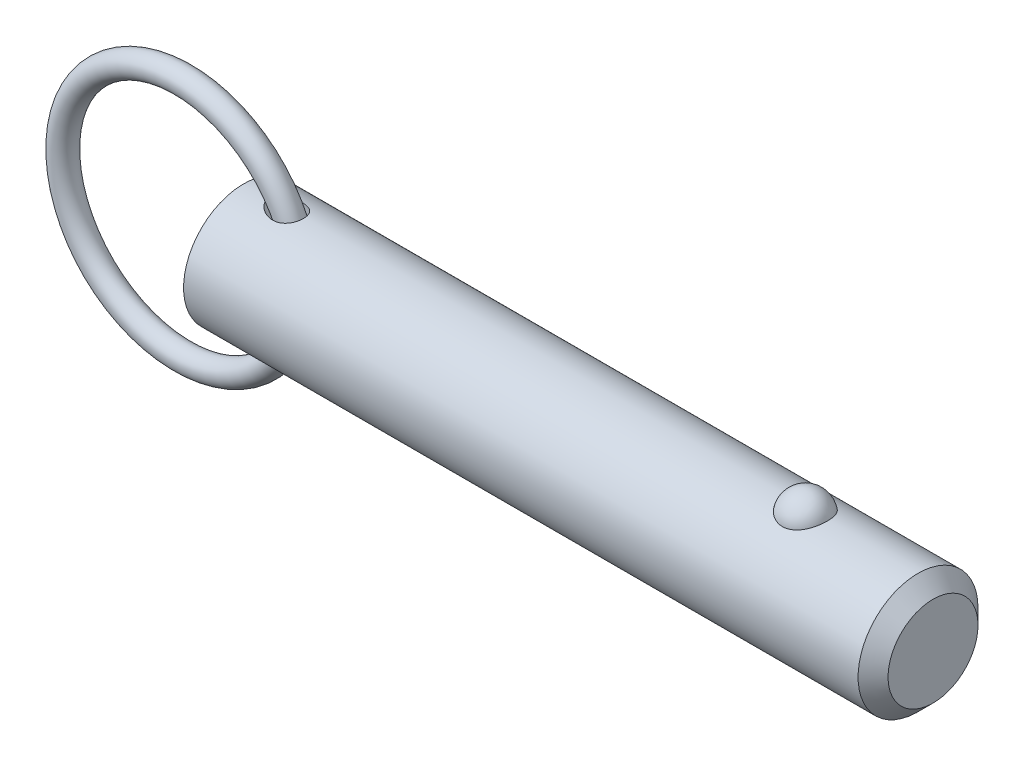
ISO-10303-21;
HEADER;
FILE_DESCRIPTION(('STEP AP214'),'2;1');
FILE_NAME('part.step','',(''),(''),'','','');
FILE_SCHEMA(('AUTOMOTIVE_DESIGN { 1 0 10303 214 1 1 1 1 }'));
ENDSEC;
DATA;
#1=APPLICATION_CONTEXT('core data for automotive mechanical design processes');
#2=APPLICATION_PROTOCOL_DEFINITION('international standard','automotive_design',2000,#1);
#3=PRODUCT_CONTEXT('',#1,'mechanical');
#4=PRODUCT('Part','Part','',(#3));
#5=PRODUCT_RELATED_PRODUCT_CATEGORY('part','',(#4));
#6=PRODUCT_DEFINITION_FORMATION('','',#4);
#7=PRODUCT_DEFINITION_CONTEXT('part definition',#1,'design');
#8=PRODUCT_DEFINITION('design','',#6,#7);
#9=PRODUCT_DEFINITION_SHAPE('','',#8);
#10=(LENGTH_UNIT() NAMED_UNIT(*) SI_UNIT(.MILLI.,.METRE.));
#11=(NAMED_UNIT(*) PLANE_ANGLE_UNIT() SI_UNIT($,.RADIAN.));
#12=(NAMED_UNIT(*) SI_UNIT($,.STERADIAN.) SOLID_ANGLE_UNIT());
#13=UNCERTAINTY_MEASURE_WITH_UNIT(LENGTH_MEASURE(1.E-05),#10,'distance_accuracy_value','');
#14=(GEOMETRIC_REPRESENTATION_CONTEXT(3) GLOBAL_UNCERTAINTY_ASSIGNED_CONTEXT((#13)) GLOBAL_UNIT_ASSIGNED_CONTEXT((#10,
#11,#12)) REPRESENTATION_CONTEXT('',''));
#15=CARTESIAN_POINT('',(0.,0.,0.));
#16=DIRECTION('',(0.,0.,1.));
#17=DIRECTION('',(1.,0.,0.));
#18=AXIS2_PLACEMENT_3D('',#15,#16,#17);
#19=CARTESIAN_POINT('',(-9.66825126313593,0.,0.));
#20=DIRECTION('',(0.,0.,1.));
#21=DIRECTION('',(1.,0.,0.));
#22=AXIS2_PLACEMENT_3D('',#19,#20,#21);
#23=TOROIDAL_SURFACE('',#22,19.05,1.905);
#24=CARTESIAN_POINT('',(11.2867487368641,0.,0.));
#25=VERTEX_POINT('',#24);
#26=VERTEX_LOOP('',#25);
#27=FACE_BOUND('',#26,.T.);
#28=ADVANCED_FACE('P0_F12',(#27),#23,.T.);
#29=CLOSED_SHELL('',(#28));
#30=MANIFOLD_SOLID_BREP('P0_B1',#29);
#31=CARTESIAN_POINT('',(0.,0.,0.));
#32=DIRECTION('',(1.,0.,0.));
#33=DIRECTION('',(0.,0.,-1.));
#34=AXIS2_PLACEMENT_3D('',#31,#32,#33);
#35=CYLINDRICAL_SURFACE('',#34,9.525);
#36=CARTESIAN_POINT('',(4.56693409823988,9.43141941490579,-1.33189820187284));
#37=CARTESIAN_POINT('',(4.70260475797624,9.41020313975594,-1.48215931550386));
#38=CARTESIAN_POINT('',(4.85555680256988,9.38755003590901,-1.61683982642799));
#39=CARTESIAN_POINT('',(5.10171959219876,9.35450554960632,-1.79512943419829));
#40=CARTESIAN_POINT('',(5.18674514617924,9.34362629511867,-1.85068909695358));
#41=CARTESIAN_POINT('',(5.36154389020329,9.32258514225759,-1.95392002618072));
#42=CARTESIAN_POINT('',(5.45131542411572,9.31242299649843,-2.00159402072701));
#43=CARTESIAN_POINT('',(5.70070211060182,9.28632120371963,-2.12033289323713));
#44=CARTESIAN_POINT('',(5.86420408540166,9.27146938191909,-2.18362944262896));
#45=CARTESIAN_POINT('',(6.19893345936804,9.24694163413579,-2.28525783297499));
#46=CARTESIAN_POINT('',(6.37015384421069,9.23726110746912,-2.32361187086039));
#47=CARTESIAN_POINT('',(6.73531776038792,9.22400982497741,-2.37575048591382));
#48=CARTESIAN_POINT('',(6.92975826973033,9.22118808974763,-2.38652934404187));
#49=CARTESIAN_POINT('',(7.21995443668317,9.22416297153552,-2.37494980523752));
#50=CARTESIAN_POINT('',(7.31643847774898,9.22635560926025,-2.366466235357));
#51=CARTESIAN_POINT('',(7.50796421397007,9.2331428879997,-2.33985028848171));
#52=CARTESIAN_POINT('',(7.60300650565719,9.23773650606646,-2.32172202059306));
#53=CARTESIAN_POINT('',(7.83273114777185,9.25183311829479,-2.26504721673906));
#54=CARTESIAN_POINT('',(7.96603028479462,9.26261470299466,-2.2209856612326));
#55=CARTESIAN_POINT('',(8.22310899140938,9.28816519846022,-2.11157306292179));
#56=CARTESIAN_POINT('',(8.34689477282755,9.30293147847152,-2.04623606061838));
#57=CARTESIAN_POINT('',(8.58136049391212,9.3349416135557,-1.89485344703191));
#58=CARTESIAN_POINT('',(8.69199721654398,9.35219324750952,-1.80874222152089));
#59=CARTESIAN_POINT('',(8.89592093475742,9.38707016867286,-1.61799188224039));
#60=CARTESIAN_POINT('',(8.98920771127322,9.40469546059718,-1.51335253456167));
#61=CARTESIAN_POINT('',(9.15057731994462,9.43713590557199,-1.29519427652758));
#62=CARTESIAN_POINT('',(9.21980158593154,9.45205440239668,-1.18253282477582));
#63=CARTESIAN_POINT('',(9.33826736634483,9.47856708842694,-0.946802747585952));
#64=CARTESIAN_POINT('',(9.38751161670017,9.49016173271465,-0.823735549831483));
#65=CARTESIAN_POINT('',(9.46423850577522,9.50859378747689,-0.572614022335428));
#66=CARTESIAN_POINT('',(9.4920239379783,9.5154972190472,-0.444656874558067));
#67=CARTESIAN_POINT('',(9.52636926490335,9.52406905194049,-0.185752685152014));
#68=CARTESIAN_POINT('',(9.5329292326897,9.52573747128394,-0.0548056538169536));
#69=CARTESIAN_POINT('',(9.52467276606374,9.52365852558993,0.206503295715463));
#70=CARTESIAN_POINT('',(9.50983454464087,9.51990564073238,0.336864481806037));
#71=CARTESIAN_POINT('',(9.45907362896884,9.50737852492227,0.59316631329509));
#72=CARTESIAN_POINT('',(9.42315106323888,9.49860432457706,0.71910698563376));
#73=CARTESIAN_POINT('',(9.33106648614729,9.47698928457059,0.96295935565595));
#74=CARTESIAN_POINT('',(9.27490839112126,9.46414923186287,1.08087260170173));
#75=CARTESIAN_POINT('',(9.1437580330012,9.43581000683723,1.30534632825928));
#76=CARTESIAN_POINT('',(9.06876720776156,9.42031103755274,1.41190767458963));
#77=CARTESIAN_POINT('',(8.90203187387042,9.38836719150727,1.61069439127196));
#78=CARTESIAN_POINT('',(8.81029913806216,9.37192298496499,1.70292975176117));
#79=CARTESIAN_POINT('',(8.61268775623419,9.33985045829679,1.87086859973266));
#80=CARTESIAN_POINT('',(8.50680947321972,9.3242221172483,1.94657251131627));
#81=CARTESIAN_POINT('',(8.28220546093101,9.29513431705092,2.08109032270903));
#82=CARTESIAN_POINT('',(8.16329919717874,9.28171415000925,2.1396103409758));
#83=CARTESIAN_POINT('',(7.91756052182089,9.25859072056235,2.23755716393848));
#84=CARTESIAN_POINT('',(7.79072606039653,9.24888842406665,2.27697900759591));
#85=CARTESIAN_POINT('',(7.52377913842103,9.23338749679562,2.33907806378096));
#86=CARTESIAN_POINT('',(7.38334767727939,9.22789571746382,2.36044900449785));
#87=CARTESIAN_POINT('',(7.10081394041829,9.22210229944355,2.3829751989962));
#88=CARTESIAN_POINT('',(6.95871103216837,9.22180269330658,2.38412253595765));
#89=CARTESIAN_POINT('',(6.65642691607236,9.22632724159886,2.36656230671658));
#90=CARTESIAN_POINT('',(6.49641694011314,9.23185415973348,2.3451317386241));
#91=CARTESIAN_POINT('',(6.18115433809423,9.24811737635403,2.28014143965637));
#92=CARTESIAN_POINT('',(6.02590710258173,9.25885936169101,2.23655754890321));
#93=CARTESIAN_POINT('',(5.6990472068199,9.28624254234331,2.12025087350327));
#94=CARTESIAN_POINT('',(5.52873601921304,9.30354853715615,2.04400672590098));
#95=CARTESIAN_POINT('',(5.20289495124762,9.34106989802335,1.86504730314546));
#96=CARTESIAN_POINT('',(5.04735968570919,9.36128419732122,1.76234172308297));
#97=CARTESIAN_POINT('',(4.79287124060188,9.39697639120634,1.55895334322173));
#98=CARTESIAN_POINT('',(4.68938704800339,9.41240250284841,1.46392900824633));
#99=CARTESIAN_POINT('',(4.49847141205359,9.44202586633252,1.25875918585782));
#100=CARTESIAN_POINT('',(4.41101129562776,9.45622528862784,1.1486413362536));
#101=CARTESIAN_POINT('',(4.27502257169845,9.47888210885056,0.940600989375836));
#102=CARTESIAN_POINT('',(4.22216329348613,9.48791121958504,0.845586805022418));
#103=CARTESIAN_POINT('',(4.13241478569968,9.50344321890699,0.648051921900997));
#104=CARTESIAN_POINT('',(4.09551182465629,9.50994827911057,0.545537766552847));
#105=CARTESIAN_POINT('',(4.04043124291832,9.51971586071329,0.334452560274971));
#106=CARTESIAN_POINT('',(4.02240728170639,9.52295176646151,0.225839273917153));
#107=CARTESIAN_POINT('',(4.00750873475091,9.52562364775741,0.00713006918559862));
#108=CARTESIAN_POINT('',(4.01062334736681,9.52506156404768,-0.10296506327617));
#109=CARTESIAN_POINT('',(4.03592967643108,9.52053221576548,-0.306944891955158));
#110=CARTESIAN_POINT('',(4.05571676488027,9.51699426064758,-0.401151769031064));
#111=CARTESIAN_POINT('',(4.10967975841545,9.5074546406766,-0.585176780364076));
#112=CARTESIAN_POINT('',(4.14385995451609,9.50145224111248,-0.674993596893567));
#113=CARTESIAN_POINT('',(4.23261356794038,9.48611703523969,-0.866116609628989));
#114=CARTESIAN_POINT('',(4.28990016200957,9.47635800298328,-0.96612166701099));
#115=CARTESIAN_POINT('',(4.41856577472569,9.45502867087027,-1.15640011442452));
#116=CARTESIAN_POINT('',(4.48996918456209,9.44345524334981,-1.24665623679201));
#117=CARTESIAN_POINT('',(4.56693409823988,9.43141941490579,-1.33189820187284));
#118=B_SPLINE_CURVE_WITH_KNOTS('',3,(#36,#37,#38,#39,#40,#41,#42,#43,#44,#45,#46,#47,#48,#49,
#50,#51,#52,#53,#54,#55,#56,#57,#58,#59,#60,#61,#62,#63,#64,#65,#66,#67,#68,#69,#70,#71,#72,#73,
#74,#75,#76,#77,#78,#79,#80,#81,#82,#83,#84,#85,#86,#87,#88,#89,#90,#91,#92,#93,#94,#95,#96,#97,
#98,#99,#100,#101,#102,#103,#104,#105,#106,#107,#108,#109,#110,#111,#112,#113,#114,#115,#116,
#117),.UNSPECIFIED.,.T.,.F.,(4,2,2,2,2,2,2,2,2,2,2,2,2,2,2,2,2,2,2,2,2,2,2,2,2,2,2,2,2,2,2,2,2,
2,2,2,2,2,2,2,4),(0.,0.609951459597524,0.916123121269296,1.22218863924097,1.74791337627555,
2.27316961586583,2.85362722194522,3.14383229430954,3.43391382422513,3.85437497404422,
4.27455920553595,4.69608835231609,5.11762282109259,5.5149005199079,5.91212379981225,
6.30363414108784,6.69514313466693,7.08705103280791,7.47895654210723,7.87078624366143,
8.26258603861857,8.65411137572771,9.04562666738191,9.44349251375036,9.84146165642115,
10.2662286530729,10.6911619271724,11.1739180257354,11.6572017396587,12.2170157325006,
12.7766249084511,13.1992556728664,13.6211226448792,13.9471990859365,14.2729943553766,
14.6014211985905,14.9296802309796,15.2173810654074,15.505167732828,15.8505863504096,
16.1966070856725),.UNSPECIFIED.);
#119=CARTESIAN_POINT('',(4.56693409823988,9.43141941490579,-1.33189820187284));
#120=VERTEX_POINT('',#119);
#121=EDGE_CURVE('P1_E40',#120,#120,#118,.T.);
#122=ORIENTED_EDGE('',*,*,#121,.T.);
#123=EDGE_LOOP('',(#122));
#124=FACE_BOUND('',#123,.T.);
#125=CARTESIAN_POINT('',(107.14875,0.,0.));
#126=DIRECTION('',(1.,0.,0.));
#127=DIRECTION('',(0.,0.,-1.));
#128=AXIS2_PLACEMENT_3D('',#125,#126,#127);
#129=CIRCLE('',#128,9.525);
#130=CARTESIAN_POINT('',(107.14875,0.,-9.525));
#131=VERTEX_POINT('',#130);
#132=EDGE_CURVE('P1_E25',#131,#131,#129,.T.);
#133=ORIENTED_EDGE('',*,*,#132,.F.);
#134=EDGE_LOOP('',(#133));
#135=FACE_BOUND('',#134,.T.);
#136=CARTESIAN_POINT('',(0.,0.,0.));
#137=DIRECTION('',(1.,0.,0.));
#138=DIRECTION('',(0.,0.,-1.));
#139=AXIS2_PLACEMENT_3D('',#136,#137,#138);
#140=CIRCLE('',#139,9.525);
#141=CARTESIAN_POINT('',(0.,0.,-9.525));
#142=VERTEX_POINT('',#141);
#143=EDGE_CURVE('P1_E9',#142,#142,#140,.T.);
#144=ORIENTED_EDGE('',*,*,#143,.T.);
#145=EDGE_LOOP('',(#144));
#146=FACE_BOUND('',#145,.T.);
#147=CARTESIAN_POINT('',(89.2457573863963,8.80405803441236,3.63513233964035));
#148=CARTESIAN_POINT('',(89.1516766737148,8.80405953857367,3.63513053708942));
#149=CARTESIAN_POINT('',(89.0575618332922,8.80561325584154,3.6313746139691));
#150=CARTESIAN_POINT('',(88.8700126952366,8.81177748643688,3.61638665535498));
#151=CARTESIAN_POINT('',(88.7765788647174,8.81638992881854,3.60514990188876));
#152=CARTESIAN_POINT('',(88.4979452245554,8.8346711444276,3.56024627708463));
#153=CARTESIAN_POINT('',(88.3146916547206,8.85278327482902,3.51538626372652));
#154=CARTESIAN_POINT('',(87.959509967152,8.89871214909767,3.39742145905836));
#155=CARTESIAN_POINT('',(87.7875533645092,8.92650327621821,3.32439116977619));
#156=CARTESIAN_POINT('',(87.458707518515,8.98874819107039,3.15220244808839));
#157=CARTESIAN_POINT('',(87.3018114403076,9.02319893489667,3.05305594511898));
#158=CARTESIAN_POINT('',(87.0022147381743,9.09629186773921,2.82797815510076));
#159=CARTESIAN_POINT('',(86.8600600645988,9.13502685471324,2.7013513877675));
#160=CARTESIAN_POINT('',(86.5982999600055,9.21186572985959,2.4264193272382));
#161=CARTESIAN_POINT('',(86.4787015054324,9.2499694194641,2.27810735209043));
#162=CARTESIAN_POINT('',(86.259645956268,9.32341082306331,1.95652290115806));
#163=CARTESIAN_POINT('',(86.1613174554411,9.35855090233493,1.78243511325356));
#164=CARTESIAN_POINT('',(85.9938190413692,9.42045142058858,1.41937246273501));
#165=CARTESIAN_POINT('',(85.9246511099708,9.44721128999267,1.23039658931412));
#166=CARTESIAN_POINT('',(85.8161994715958,9.48990641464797,0.840370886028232));
#167=CARTESIAN_POINT('',(85.7772880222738,9.50570658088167,0.639202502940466));
#168=CARTESIAN_POINT('',(85.7315550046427,9.52433146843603,0.232664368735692));
#169=CARTESIAN_POINT('',(85.7247324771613,9.52715657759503,0.0272947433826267));
#170=CARTESIAN_POINT('',(85.743255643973,9.51956918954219,-0.380478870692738));
#171=CARTESIAN_POINT('',(85.7684052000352,9.50923740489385,-0.582893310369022));
#172=CARTESIAN_POINT('',(85.8500253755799,9.47651897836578,-0.98029399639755));
#173=CARTESIAN_POINT('',(85.9064966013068,9.45413210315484,-1.17528009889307));
#174=CARTESIAN_POINT('',(86.0497192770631,9.39954044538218,-1.55263697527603));
#175=CARTESIAN_POINT('',(86.1365124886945,9.36732213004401,-1.73498993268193));
#176=CARTESIAN_POINT('',(86.3386103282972,9.29640700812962,-2.08177763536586));
#177=CARTESIAN_POINT('',(86.4539172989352,9.25770966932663,-2.24621090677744));
#178=CARTESIAN_POINT('',(86.711264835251,9.17775604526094,-2.55338333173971));
#179=CARTESIAN_POINT('',(86.8534344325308,9.136488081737,-2.69601150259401));
#180=CARTESIAN_POINT('',(87.16089985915,9.05620497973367,-2.95451229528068));
#181=CARTESIAN_POINT('',(87.326193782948,9.01718965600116,-3.07038711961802));
#182=CARTESIAN_POINT('',(87.672052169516,8.9468001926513,-3.26976836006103));
#183=CARTESIAN_POINT('',(87.8522278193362,8.91528408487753,-3.35389750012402));
#184=CARTESIAN_POINT('',(88.2256514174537,8.86272514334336,-3.49043503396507));
#185=CARTESIAN_POINT('',(88.418894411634,8.8416783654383,-3.54285537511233));
#186=CARTESIAN_POINT('',(88.8025036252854,8.81348056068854,-3.61241306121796));
#187=CARTESIAN_POINT('',(88.9925251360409,8.80568348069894,-3.63119339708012));
#188=CARTESIAN_POINT('',(89.3731906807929,8.80289410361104,-3.63795342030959));
#189=CARTESIAN_POINT('',(89.5638345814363,8.80789922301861,-3.62593932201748));
#190=CARTESIAN_POINT('',(89.934007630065,8.8297491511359,-3.57238430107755));
#191=CARTESIAN_POINT('',(90.1136976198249,8.84621463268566,-3.53178890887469));
#192=CARTESIAN_POINT('',(90.4634226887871,8.88875330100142,-3.42331083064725));
#193=CARTESIAN_POINT('',(90.6334569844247,8.91482726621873,-3.35542593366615));
#194=CARTESIAN_POINT('',(90.9632377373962,8.97448239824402,-3.19248225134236));
#195=CARTESIAN_POINT('',(91.1226801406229,9.00821446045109,-3.09686474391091));
#196=CARTESIAN_POINT('',(91.4235136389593,9.07935398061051,-2.88162736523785));
#197=CARTESIAN_POINT('',(91.5649005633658,9.11676228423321,-2.76200196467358));
#198=CARTESIAN_POINT('',(91.8333193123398,9.19347419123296,-2.49516285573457));
#199=CARTESIAN_POINT('',(91.9592750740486,9.23277872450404,-2.34686614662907));
#200=CARTESIAN_POINT('',(92.1855227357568,9.30737610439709,-2.03093683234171));
#201=CARTESIAN_POINT('',(92.2858100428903,9.34266823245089,-1.86330077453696));
#202=CARTESIAN_POINT('',(92.4615149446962,9.40674710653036,-1.50744893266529));
#203=CARTESIAN_POINT('',(92.536041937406,9.43529176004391,-1.31874876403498));
#204=CARTESIAN_POINT('',(92.6541650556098,9.48144132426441,-0.930631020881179));
#205=CARTESIAN_POINT('',(92.6977608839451,9.49904612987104,-0.731213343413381));
#206=CARTESIAN_POINT('',(92.7531580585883,9.5215314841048,-0.32714729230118));
#207=CARTESIAN_POINT('',(92.7649354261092,9.52640243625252,-0.122495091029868));
#208=CARTESIAN_POINT('',(92.7563825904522,9.52289571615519,0.286018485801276));
#209=CARTESIAN_POINT('',(92.7360530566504,9.51451832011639,0.489879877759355));
#210=CARTESIAN_POINT('',(92.6638840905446,9.48544083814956,0.889994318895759));
#211=CARTESIAN_POINT('',(92.6121993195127,9.46480124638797,1.08627971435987));
#212=CARTESIAN_POINT('',(92.4784917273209,9.41333895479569,1.46682086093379));
#213=CARTESIAN_POINT('',(92.3964668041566,9.38251554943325,1.65107577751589));
#214=CARTESIAN_POINT('',(92.2031929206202,9.31365636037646,2.00346348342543));
#215=CARTESIAN_POINT('',(92.0917838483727,9.27558138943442,2.17150083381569));
#216=CARTESIAN_POINT('',(91.8422947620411,9.19638714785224,2.4856311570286));
#217=CARTESIAN_POINT('',(91.7042163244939,9.15526805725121,2.63172542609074));
#218=CARTESIAN_POINT('',(91.4048438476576,9.07465393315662,2.89750997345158));
#219=CARTESIAN_POINT('',(91.2436109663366,9.03515496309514,3.01726776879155));
#220=CARTESIAN_POINT('',(90.9016136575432,8.96227564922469,3.22732920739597));
#221=CARTESIAN_POINT('',(90.720841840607,8.92889763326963,3.31762165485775));
#222=CARTESIAN_POINT('',(90.3514451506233,8.8734538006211,3.46314419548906));
#223=CARTESIAN_POINT('',(90.1633237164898,8.85102983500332,3.51950082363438));
#224=CARTESIAN_POINT('',(89.8757869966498,8.82666967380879,3.57993683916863));
#225=CARTESIAN_POINT('',(89.7791339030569,8.82009725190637,3.59606217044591));
#226=CARTESIAN_POINT('',(89.5846770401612,8.81020897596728,3.62022512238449));
#227=CARTESIAN_POINT('',(89.4868741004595,8.80689090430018,3.62826825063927));
#228=CARTESIAN_POINT('',(89.3412243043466,8.80445615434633,3.63416760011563));
#229=CARTESIAN_POINT('',(89.2934952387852,8.80405727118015,3.63513325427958));
#230=CARTESIAN_POINT('',(89.2457573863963,8.80405803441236,3.63513233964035));
#231=B_SPLINE_CURVE_WITH_KNOTS('',3,(#147,#148,#149,#150,#151,#152,#153,#154,#155,#156,#157,
#158,#159,#160,#161,#162,#163,#164,#165,#166,#167,#168,#169,#170,#171,#172,#173,#174,#175,#176,
#177,#178,#179,#180,#181,#182,#183,#184,#185,#186,#187,#188,#189,#190,#191,#192,#193,#194,#195,
#196,#197,#198,#199,#200,#201,#202,#203,#204,#205,#206,#207,#208,#209,#210,#211,#212,#213,#214,
#215,#216,#217,#218,#219,#220,#221,#222,#223,#224,#225,#226,#227,#228,#229,#230),.UNSPECIFIED.,
.T.,.F.,(4,2,2,2,2,2,2,2,2,2,2,2,2,2,2,2,2,2,2,2,2,2,2,2,2,2,2,2,2,2,2,2,2,2,2,2,2,2,2,2,2,4),
(0.,0.282202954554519,0.564584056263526,1.13017050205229,1.69427128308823,2.258114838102,
2.83836627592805,3.41879688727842,4.02497117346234,4.63118665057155,5.24474754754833,
5.85829010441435,6.46808687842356,7.0778954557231,7.68854723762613,8.29924920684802,
8.91296283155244,9.52662591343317,10.1275338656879,10.7282152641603,11.2986646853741,
11.868998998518,12.4213015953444,12.973648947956,13.5380053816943,14.1024919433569,
14.695298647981,15.2882113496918,15.8999469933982,16.5116885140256,17.1238909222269,
17.7360805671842,18.3452748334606,18.9545113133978,19.567138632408,20.1797297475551,
20.7907316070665,21.4019653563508,21.9915938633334,22.2859053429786,22.580016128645,
22.723209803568),.UNSPECIFIED.);
#232=CARTESIAN_POINT('',(89.2457573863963,8.80405803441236,3.63513233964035));
#233=VERTEX_POINT('',#232);
#234=EDGE_CURVE('P1_E34',#233,#233,#231,.T.);
#235=ORIENTED_EDGE('',*,*,#234,.T.);
#236=EDGE_LOOP('',(#235));
#237=FACE_BOUND('',#236,.T.);
#238=CARTESIAN_POINT('',(4.56693409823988,-9.43141941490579,-1.33189820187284));
#239=CARTESIAN_POINT('',(4.48932984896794,-9.4435553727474,-1.24594548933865));
#240=CARTESIAN_POINT('',(4.41737309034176,-9.45522193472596,-1.1548795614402));
#241=CARTESIAN_POINT('',(4.2878104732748,-9.47670896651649,-0.962782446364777));
#242=CARTESIAN_POINT('',(4.23019403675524,-9.48653079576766,-0.861758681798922));
#243=CARTESIAN_POINT('',(4.13254559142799,-9.5034118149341,-0.649723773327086));
#244=CARTESIAN_POINT('',(4.09271158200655,-9.51043980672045,-0.538615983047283));
#245=CARTESIAN_POINT('',(4.04973167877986,-9.51806966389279,-0.367764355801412));
#246=CARTESIAN_POINT('',(4.03820037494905,-9.52012756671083,-0.310118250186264));
#247=CARTESIAN_POINT('',(4.02100287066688,-9.52320274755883,-0.193935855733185));
#248=CARTESIAN_POINT('',(4.01533565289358,-9.52422020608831,-0.13539972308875));
#249=CARTESIAN_POINT('',(4.00817074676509,-9.52550497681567,0.0247266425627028));
#250=CARTESIAN_POINT('',(4.01270492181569,-9.52468821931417,0.126661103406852));
#251=CARTESIAN_POINT('',(4.03954973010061,-9.51988506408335,0.328012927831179));
#252=CARTESIAN_POINT('',(4.06186450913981,-9.51589792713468,0.427429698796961));
#253=CARTESIAN_POINT('',(4.12088980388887,-9.5054852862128,0.61636200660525));
#254=CARTESIAN_POINT('',(4.15684838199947,-9.49918763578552,0.706123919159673));
#255=CARTESIAN_POINT('',(4.24094647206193,-9.48470618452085,0.879522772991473));
#256=CARTESIAN_POINT('',(4.28909090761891,-9.47652162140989,0.96315722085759));
#257=CARTESIAN_POINT('',(4.42295891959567,-9.45426317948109,1.16513741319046));
#258=CARTESIAN_POINT('',(4.5152375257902,-9.43933320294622,1.27905352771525));
#259=CARTESIAN_POINT('',(4.71682295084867,-9.40825940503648,1.49055892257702));
#260=CARTESIAN_POINT('',(4.8261728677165,-9.39211256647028,1.58810554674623));
#261=CARTESIAN_POINT('',(5.09064226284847,-9.35555264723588,1.79246125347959));
#262=CARTESIAN_POINT('',(5.24990411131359,-9.33524115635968,1.89393122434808));
#263=CARTESIAN_POINT('',(5.58309255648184,-9.29785396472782,2.06968659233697));
#264=CARTESIAN_POINT('',(5.7570289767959,-9.28078045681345,2.14395359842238));
#265=CARTESIAN_POINT('',(6.11646882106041,-9.25213303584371,2.26440412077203));
#266=CARTESIAN_POINT('',(6.30205582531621,-9.2406056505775,2.31035092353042));
#267=CARTESIAN_POINT('',(6.67856093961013,-9.22541807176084,2.37029728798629));
#268=CARTESIAN_POINT('',(6.8694704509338,-9.2217458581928,2.3843456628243));
#269=CARTESIAN_POINT('',(7.21217144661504,-9.22344239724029,2.37775005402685));
#270=CARTESIAN_POINT('',(7.36409439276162,-9.22713860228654,2.36352577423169));
#271=CARTESIAN_POINT('',(7.66346227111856,-9.24048072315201,2.31082299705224));
#272=CARTESIAN_POINT('',(7.81090958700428,-9.25012341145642,2.27235765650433));
#273=CARTESIAN_POINT('',(8.09730316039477,-9.2746609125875,2.17003648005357));
#274=CARTESIAN_POINT('',(8.23619652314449,-9.28958517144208,2.10603803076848));
#275=CARTESIAN_POINT('',(8.49918675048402,-9.32290326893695,1.9532444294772));
#276=CARTESIAN_POINT('',(8.62328895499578,-9.34129584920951,1.86445826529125));
#277=CARTESIAN_POINT('',(8.84006515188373,-9.37706953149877,1.67466761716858));
#278=CARTESIAN_POINT('',(8.93465172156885,-9.39436331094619,1.57582357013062));
#279=CARTESIAN_POINT('',(9.1049023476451,-9.42761680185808,1.362809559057));
#280=CARTESIAN_POINT('',(9.18057146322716,-9.44357686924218,1.24864370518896));
#281=CARTESIAN_POINT('',(9.30789178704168,-9.47159985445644,1.01379272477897));
#282=CARTESIAN_POINT('',(9.36045544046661,-9.48380365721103,0.893617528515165));
#283=CARTESIAN_POINT('',(9.44498362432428,-9.50388751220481,0.645890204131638));
#284=CARTESIAN_POINT('',(9.47694947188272,-9.51176784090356,0.518338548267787));
#285=CARTESIAN_POINT('',(9.51944262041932,-9.52232073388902,0.260103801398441));
#286=CARTESIAN_POINT('',(9.53006646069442,-9.52501674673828,0.129437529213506));
#287=CARTESIAN_POINT('',(9.52993291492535,-9.52498309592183,-0.131885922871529));
#288=CARTESIAN_POINT('',(9.51917525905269,-9.52225336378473,-0.262543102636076));
#289=CARTESIAN_POINT('',(9.47648788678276,-9.51165418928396,-0.520312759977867));
#290=CARTESIAN_POINT('',(9.44453086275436,-9.50377811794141,-0.647420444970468));
#291=CARTESIAN_POINT('',(9.36015568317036,-9.48373425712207,-0.894290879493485));
#292=CARTESIAN_POINT('',(9.30773827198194,-9.47156662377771,-1.01405389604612));
#293=CARTESIAN_POINT('',(9.18380895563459,-9.44428888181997,-1.24269386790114));
#294=CARTESIAN_POINT('',(9.11232064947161,-9.42918241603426,-1.3515840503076));
#295=CARTESIAN_POINT('',(8.95212687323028,-9.39767706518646,-1.55562459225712));
#296=CARTESIAN_POINT('',(8.86342281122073,-9.3812782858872,-1.65077607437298));
#297=CARTESIAN_POINT('',(8.6710444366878,-9.34891827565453,-1.82517515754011));
#298=CARTESIAN_POINT('',(8.56732858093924,-9.33295841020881,-1.90437711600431));
#299=CARTESIAN_POINT('',(8.34818438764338,-9.30317889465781,-2.0449122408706));
#300=CARTESIAN_POINT('',(8.23275529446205,-9.2893593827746,-2.10624425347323));
#301=CARTESIAN_POINT('',(7.98961240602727,-9.26475003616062,-2.2120340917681));
#302=CARTESIAN_POINT('',(7.86162088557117,-9.25407358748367,-2.25587700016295));
#303=CARTESIAN_POINT('',(7.60027499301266,-9.23720810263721,-2.32397032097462));
#304=CARTESIAN_POINT('',(7.46691858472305,-9.23102078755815,-2.34821321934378));
#305=CARTESIAN_POINT('',(7.18516230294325,-9.22302718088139,-2.37943079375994));
#306=CARTESIAN_POINT('',(7.0365445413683,-9.22169704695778,-2.38452997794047));
#307=CARTESIAN_POINT('',(6.74015049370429,-9.22442327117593,-2.37395141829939));
#308=CARTESIAN_POINT('',(6.59237455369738,-9.22848170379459,-2.35826567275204));
#309=CARTESIAN_POINT('',(6.27762777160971,-9.2422287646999,-2.30385559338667));
#310=CARTESIAN_POINT('',(6.11124715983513,-9.25269504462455,-2.26192683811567));
#311=CARTESIAN_POINT('',(5.78635920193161,-9.27830776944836,-2.15445569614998));
#312=CARTESIAN_POINT('',(5.62786567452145,-9.29346211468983,-2.08887341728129));
#313=CARTESIAN_POINT('',(5.3901306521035,-9.31931237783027,-1.96924953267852));
#314=CARTESIAN_POINT('',(5.30683088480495,-9.32901725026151,-1.92292485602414));
#315=CARTESIAN_POINT('',(5.14455801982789,-9.34899035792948,-1.82334419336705));
#316=CARTESIAN_POINT('',(5.06558607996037,-9.35925874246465,-1.77008636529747));
#317=CARTESIAN_POINT('',(4.83670950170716,-9.39034445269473,-1.60010986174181));
#318=CARTESIAN_POINT('',(4.69422471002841,-9.41151337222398,-1.47288240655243));
#319=CARTESIAN_POINT('',(4.56693409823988,-9.43141941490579,-1.33189820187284));
#320=B_SPLINE_CURVE_WITH_KNOTS('',3,(#238,#239,#240,#241,#242,#243,#244,#245,#246,#247,#248,
#249,#250,#251,#252,#253,#254,#255,#256,#257,#258,#259,#260,#261,#262,#263,#264,#265,#266,#267,
#268,#269,#270,#271,#272,#273,#274,#275,#276,#277,#278,#279,#280,#281,#282,#283,#284,#285,#286,
#287,#288,#289,#290,#291,#292,#293,#294,#295,#296,#297,#298,#299,#300,#301,#302,#303,#304,#305,
#306,#307,#308,#309,#310,#311,#312,#313,#314,#315,#316,#317,#318,#319),.UNSPECIFIED.,.T.,.F.,(4,
2,2,2,2,2,2,2,2,2,2,2,2,2,2,2,2,2,2,2,2,2,2,2,2,2,2,2,2,2,2,2,2,2,2,2,2,2,2,2,4),(0.,
0.348900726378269,0.697543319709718,1.0499765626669,1.22617690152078,1.40234666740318,
1.70666745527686,2.01105922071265,2.30066493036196,2.59038784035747,3.03001384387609,
3.4707682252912,4.03766594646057,4.60494622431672,5.17690598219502,5.74798989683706,
6.2040084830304,6.65977977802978,7.11813321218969,7.57632066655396,7.98791759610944,
8.39940433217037,8.79273459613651,9.18603970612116,9.577561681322,9.96908859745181,
10.3611208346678,10.7531388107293,11.1446739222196,11.536177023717,11.9287850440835,
12.3214184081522,12.7268448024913,13.1324265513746,13.5768390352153,14.0214226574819,
14.5351685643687,15.0497849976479,15.3368801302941,15.6240516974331,16.1963372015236),.UNSPECIFIED.);
#321=CARTESIAN_POINT('',(4.56693409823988,-9.43141941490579,-1.33189820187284));
#322=VERTEX_POINT('',#321);
#323=EDGE_CURVE('P1_E17',#322,#322,#320,.T.);
#324=ORIENTED_EDGE('',*,*,#323,.T.);
#325=EDGE_LOOP('',(#324));
#326=FACE_BOUND('',#325,.T.);
#327=ADVANCED_FACE('P1_F13',(#124,#135,#146,#237,#326),#35,.T.);
#328=CARTESIAN_POINT('',(0.,0.,0.));
#329=DIRECTION('',(-1.,0.,0.));
#330=DIRECTION('',(0.,0.,1.));
#331=AXIS2_PLACEMENT_3D('',#328,#329,#330);
#332=PLANE('',#331);
#333=ORIENTED_EDGE('',*,*,#143,.F.);
#334=EDGE_LOOP('',(#333));
#335=FACE_BOUND('',#334,.T.);
#336=ADVANCED_FACE('P1_F15',(#335),#332,.T.);
#337=CARTESIAN_POINT('',(109.53,0.,0.));
#338=DIRECTION('',(-1.,0.,0.));
#339=DIRECTION('',(0.,0.,1.));
#340=AXIS2_PLACEMENT_3D('',#337,#338,#339);
#341=CONICAL_SURFACE('',#340,7.14375000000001,0.785398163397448);
#342=ORIENTED_EDGE('',*,*,#132,.T.);
#343=EDGE_LOOP('',(#342));
#344=FACE_BOUND('',#343,.T.);
#345=CARTESIAN_POINT('',(109.53,0.,0.));
#346=DIRECTION('',(1.,0.,0.));
#347=DIRECTION('',(0.,0.,-1.));
#348=AXIS2_PLACEMENT_3D('',#345,#346,#347);
#349=CIRCLE('',#348,7.14375000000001);
#350=CARTESIAN_POINT('',(109.53,0.,-7.14375000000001));
#351=VERTEX_POINT('',#350);
#352=EDGE_CURVE('P1_E30',#351,#351,#349,.T.);
#353=ORIENTED_EDGE('',*,*,#352,.F.);
#354=EDGE_LOOP('',(#353));
#355=FACE_BOUND('',#354,.T.);
#356=ADVANCED_FACE('P1_F55',(#344,#355),#341,.T.);
#357=CARTESIAN_POINT('',(109.53,7.14375000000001,0.));
#358=DIRECTION('',(1.,0.,0.));
#359=DIRECTION('',(0.,0.,-1.));
#360=AXIS2_PLACEMENT_3D('',#357,#358,#359);
#361=PLANE('',#360);
#362=ORIENTED_EDGE('',*,*,#352,.T.);
#363=EDGE_LOOP('',(#362));
#364=FACE_BOUND('',#363,.T.);
#365=ADVANCED_FACE('P1_F51',(#364),#361,.T.);
#366=CARTESIAN_POINT('',(89.2457573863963,8.57249999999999,0.));
#367=DIRECTION('',(-1.,0.,0.));
#368=DIRECTION('',(0.,1.,0.));
#369=AXIS2_PLACEMENT_3D('',#366,#367,#368);
#370=SPHERICAL_SURFACE('',#369,3.64250000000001);
#371=ORIENTED_EDGE('',*,*,#234,.F.);
#372=EDGE_LOOP('',(#371));
#373=FACE_BOUND('',#372,.T.);
#374=ADVANCED_FACE('P1_F46',(#373),#370,.T.);
#375=CARTESIAN_POINT('',(-9.66825126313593,0.,0.));
#376=DIRECTION('',(0.,0.,1.));
#377=DIRECTION('',(1.,0.,0.));
#378=AXIS2_PLACEMENT_3D('',#375,#376,#377);
#379=TOROIDAL_SURFACE('',#378,19.05,2.38125);
#380=ORIENTED_EDGE('',*,*,#323,.F.);
#381=EDGE_LOOP('',(#380));
#382=FACE_BOUND('',#381,.T.);
#383=ORIENTED_EDGE('',*,*,#121,.F.);
#384=EDGE_LOOP('',(#383));
#385=FACE_BOUND('',#384,.T.);
#386=ADVANCED_FACE('P1_F50',(#382,#385),#379,.F.);
#387=CLOSED_SHELL('',(#327,#336,#356,#365,#374,#386));
#388=MANIFOLD_SOLID_BREP('P1_B1',#387);
#389=ADVANCED_BREP_SHAPE_REPRESENTATION('',(#18,#30,#388),#14);
#390=SHAPE_DEFINITION_REPRESENTATION(#9,#389);
ENDSEC;
END-ISO-10303-21;
